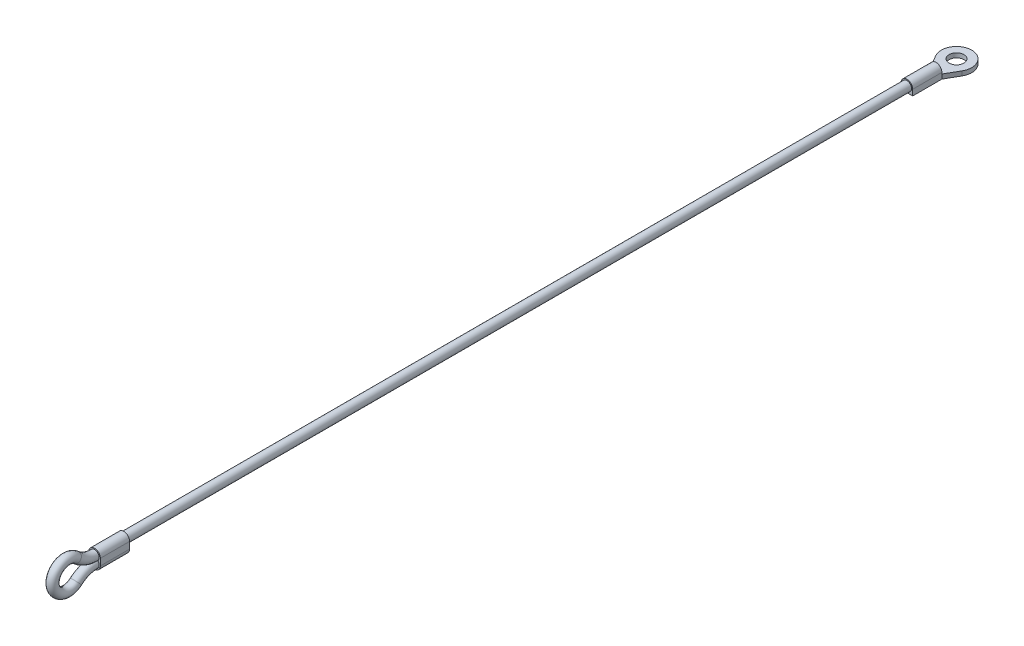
ISO-10303-21;
HEADER;
FILE_DESCRIPTION(('STEP AP214'),'2;1');
FILE_NAME('part.step','',(''),(''),'','','');
FILE_SCHEMA(('AUTOMOTIVE_DESIGN { 1 0 10303 214 1 1 1 1 }'));
ENDSEC;
DATA;
#1=APPLICATION_CONTEXT('core data for automotive mechanical design processes');
#2=APPLICATION_PROTOCOL_DEFINITION('international standard','automotive_design',2000,#1);
#3=PRODUCT_CONTEXT('',#1,'mechanical');
#4=PRODUCT('Part','Part','',(#3));
#5=PRODUCT_RELATED_PRODUCT_CATEGORY('part','',(#4));
#6=PRODUCT_DEFINITION_FORMATION('','',#4);
#7=PRODUCT_DEFINITION_CONTEXT('part definition',#1,'design');
#8=PRODUCT_DEFINITION('design','',#6,#7);
#9=PRODUCT_DEFINITION_SHAPE('','',#8);
#10=(LENGTH_UNIT() NAMED_UNIT(*) SI_UNIT(.MILLI.,.METRE.));
#11=(NAMED_UNIT(*) PLANE_ANGLE_UNIT() SI_UNIT($,.RADIAN.));
#12=(NAMED_UNIT(*) SI_UNIT($,.STERADIAN.) SOLID_ANGLE_UNIT());
#13=UNCERTAINTY_MEASURE_WITH_UNIT(LENGTH_MEASURE(1.E-05),#10,'distance_accuracy_value','');
#14=(GEOMETRIC_REPRESENTATION_CONTEXT(3) GLOBAL_UNCERTAINTY_ASSIGNED_CONTEXT((#13)) GLOBAL_UNIT_ASSIGNED_CONTEXT((#10,
#11,#12)) REPRESENTATION_CONTEXT('',''));
#15=CARTESIAN_POINT('',(0.,0.,0.));
#16=DIRECTION('',(0.,0.,1.));
#17=DIRECTION('',(1.,0.,0.));
#18=AXIS2_PLACEMENT_3D('',#15,#16,#17);
#19=CARTESIAN_POINT('',(0.,0.,-10.));
#20=DIRECTION('',(0.,0.,-1.));
#21=DIRECTION('',(-1.,0.,0.));
#22=AXIS2_PLACEMENT_3D('',#19,#20,#21);
#23=PLANE('',#22);
#24=DIRECTION('',(0.,-1.,0.));
#25=VECTOR('',#24,1.);
#26=CARTESIAN_POINT('',(1.99,0.,-10.));
#27=LINE('',#26,#25);
#28=CARTESIAN_POINT('',(1.99,0.,-10.));
#29=VERTEX_POINT('',#28);
#30=CARTESIAN_POINT('',(1.99,-0.47,-10.));
#31=VERTEX_POINT('',#30);
#32=EDGE_CURVE('E184',#29,#31,#27,.T.);
#33=ORIENTED_EDGE('',*,*,#32,.T.);
#34=DIRECTION('',(-1.,0.,0.));
#35=VECTOR('',#34,1.);
#36=CARTESIAN_POINT('',(-1.99,-0.47,-10.));
#37=LINE('',#36,#35);
#38=CARTESIAN_POINT('',(-1.99,-0.47,-10.));
#39=VERTEX_POINT('',#38);
#40=EDGE_CURVE('E141',#31,#39,#37,.T.);
#41=ORIENTED_EDGE('',*,*,#40,.T.);
#42=DIRECTION('',(0.,1.,0.));
#43=VECTOR('',#42,1.);
#44=CARTESIAN_POINT('',(-1.99,-1.99,-10.));
#45=LINE('',#44,#43);
#46=CARTESIAN_POINT('',(-1.99,0.,-10.));
#47=VERTEX_POINT('',#46);
#48=EDGE_CURVE('E189',#39,#47,#45,.T.);
#49=ORIENTED_EDGE('',*,*,#48,.T.);
#50=CARTESIAN_POINT('',(0.,0.,-10.));
#51=DIRECTION('',(0.,0.,-1.));
#52=DIRECTION('',(-1.,0.,0.));
#53=AXIS2_PLACEMENT_3D('',#50,#51,#52);
#54=CIRCLE('',#53,1.99);
#55=EDGE_CURVE('E180',#47,#29,#54,.T.);
#56=ORIENTED_EDGE('',*,*,#55,.T.);
#57=EDGE_LOOP('',(#33,#41,#49,#56));
#58=FACE_BOUND('',#57,.T.);
#59=ADVANCED_FACE('F39',(#58),#23,.T.);
#60=CARTESIAN_POINT('',(0.,0.,278.2));
#61=DIRECTION('',(0.,0.,-1.));
#62=DIRECTION('',(-1.,0.,0.));
#63=AXIS2_PLACEMENT_3D('',#60,#61,#62);
#64=CYLINDRICAL_SURFACE('',#63,1.59);
#65=CARTESIAN_POINT('',(0.,0.,268.2));
#66=DIRECTION('',(0.,0.,-1.));
#67=DIRECTION('',(0.,1.,0.));
#68=AXIS2_PLACEMENT_3D('',#65,#66,#67);
#69=CIRCLE('',#68,1.59);
#70=CARTESIAN_POINT('',(0.,1.59,268.2));
#71=VERTEX_POINT('',#70);
#72=EDGE_CURVE('E43',#71,#71,#69,.T.);
#73=ORIENTED_EDGE('',*,*,#72,.T.);
#74=EDGE_LOOP('',(#73));
#75=FACE_BOUND('',#74,.T.);
#76=CARTESIAN_POINT('',(0.,0.,0.));
#77=DIRECTION('',(0.,0.,1.));
#78=DIRECTION('',(1.,0.,0.));
#79=AXIS2_PLACEMENT_3D('',#76,#77,#78);
#80=CIRCLE('',#79,1.59);
#81=CARTESIAN_POINT('',(1.59,0.,0.));
#82=VERTEX_POINT('',#81);
#83=EDGE_CURVE('E219',#82,#82,#80,.T.);
#84=ORIENTED_EDGE('',*,*,#83,.T.);
#85=EDGE_LOOP('',(#84));
#86=FACE_BOUND('',#85,.T.);
#87=ADVANCED_FACE('F41',(#75,#86),#64,.T.);
#88=CARTESIAN_POINT('',(0.,3.87710696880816E-13,268.2));
#89=DIRECTION('',(0.,0.,1.));
#90=DIRECTION('',(0.,-1.,0.));
#91=AXIS2_PLACEMENT_3D('',#88,#89,#90);
#92=CYLINDRICAL_SURFACE('',#91,1.99);
#93=CARTESIAN_POINT('',(0.,4.0216672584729E-13,278.2));
#94=DIRECTION('',(0.,0.,-1.));
#95=DIRECTION('',(0.,1.,0.));
#96=AXIS2_PLACEMENT_3D('',#93,#94,#95);
#97=CIRCLE('',#96,1.99);
#98=CARTESIAN_POINT('',(-1.99,4.0241043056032E-13,278.2));
#99=VERTEX_POINT('',#98);
#100=CARTESIAN_POINT('',(1.99,4.0192302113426E-13,278.2));
#101=VERTEX_POINT('',#100);
#102=EDGE_CURVE('E235',#99,#101,#97,.T.);
#103=ORIENTED_EDGE('',*,*,#102,.T.);
#104=DIRECTION('',(0.,0.,1.));
#105=VECTOR('',#104,1.);
#106=CARTESIAN_POINT('',(1.99,3.87466992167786E-13,268.2));
#107=LINE('',#106,#105);
#108=CARTESIAN_POINT('',(1.99,3.87466992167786E-13,268.2));
#109=VERTEX_POINT('',#108);
#110=EDGE_CURVE('E257',#109,#101,#107,.T.);
#111=ORIENTED_EDGE('',*,*,#110,.F.);
#112=CARTESIAN_POINT('',(0.,3.87710696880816E-13,268.2));
#113=DIRECTION('',(0.,0.,-1.));
#114=DIRECTION('',(0.,1.,0.));
#115=AXIS2_PLACEMENT_3D('',#112,#113,#114);
#116=CIRCLE('',#115,1.99);
#117=CARTESIAN_POINT('',(-1.99,3.87954401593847E-13,268.2));
#118=VERTEX_POINT('',#117);
#119=EDGE_CURVE('E220',#118,#109,#116,.T.);
#120=ORIENTED_EDGE('',*,*,#119,.F.);
#121=DIRECTION('',(0.,0.,1.));
#122=VECTOR('',#121,1.);
#123=CARTESIAN_POINT('',(-1.99,3.87954401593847E-13,268.2));
#124=LINE('',#123,#122);
#125=EDGE_CURVE('E234',#118,#99,#124,.T.);
#126=ORIENTED_EDGE('',*,*,#125,.T.);
#127=EDGE_LOOP('',(#103,#111,#120,#126));
#128=FACE_BOUND('',#127,.T.);
#129=ADVANCED_FACE('F289',(#128),#92,.T.);
#130=CARTESIAN_POINT('',(1.99,3.87466992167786E-13,268.2));
#131=DIRECTION('',(-1.,0.,0.));
#132=DIRECTION('',(0.,-1.,0.));
#133=AXIS2_PLACEMENT_3D('',#130,#131,#132);
#134=PLANE('',#133);
#135=DIRECTION('',(0.,-1.,0.));
#136=VECTOR('',#135,1.);
#137=CARTESIAN_POINT('',(1.99,4.0192302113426E-13,278.2));
#138=LINE('',#137,#136);
#139=CARTESIAN_POINT('',(1.99,-2.26625258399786,278.2));
#140=VERTEX_POINT('',#139);
#141=EDGE_CURVE('E238',#101,#140,#138,.T.);
#142=ORIENTED_EDGE('',*,*,#141,.T.);
#143=DIRECTION('',(0.,0.,1.));
#144=VECTOR('',#143,1.);
#145=CARTESIAN_POINT('',(1.99,-2.26625258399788,268.2));
#146=LINE('',#145,#144);
#147=CARTESIAN_POINT('',(1.99,-2.26625258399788,268.2));
#148=VERTEX_POINT('',#147);
#149=EDGE_CURVE('E253',#148,#140,#146,.T.);
#150=ORIENTED_EDGE('',*,*,#149,.F.);
#151=DIRECTION('',(0.,-1.,0.));
#152=VECTOR('',#151,1.);
#153=CARTESIAN_POINT('',(1.99,3.87466992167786E-13,268.2));
#154=LINE('',#153,#152);
#155=EDGE_CURVE('E224',#109,#148,#154,.T.);
#156=ORIENTED_EDGE('',*,*,#155,.F.);
#157=ORIENTED_EDGE('',*,*,#110,.T.);
#158=EDGE_LOOP('',(#142,#150,#156,#157));
#159=FACE_BOUND('',#158,.T.);
#160=ADVANCED_FACE('F341',(#159),#134,.F.);
#161=CARTESIAN_POINT('',(0.,-2.26625258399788,268.2));
#162=DIRECTION('',(0.,0.,1.));
#163=DIRECTION('',(0.,-1.,0.));
#164=AXIS2_PLACEMENT_3D('',#161,#162,#163);
#165=CYLINDRICAL_SURFACE('',#164,1.99);
#166=CARTESIAN_POINT('',(0.,-2.26625258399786,278.2));
#167=DIRECTION('',(0.,0.,-1.));
#168=DIRECTION('',(0.,1.,0.));
#169=AXIS2_PLACEMENT_3D('',#166,#167,#168);
#170=CIRCLE('',#169,1.99);
#171=CARTESIAN_POINT('',(-1.99,-2.26625258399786,278.2));
#172=VERTEX_POINT('',#171);
#173=EDGE_CURVE('E241',#140,#172,#170,.T.);
#174=ORIENTED_EDGE('',*,*,#173,.T.);
#175=DIRECTION('',(0.,0.,1.));
#176=VECTOR('',#175,1.);
#177=CARTESIAN_POINT('',(-1.99,-2.26625258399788,268.2));
#178=LINE('',#177,#176);
#179=CARTESIAN_POINT('',(-1.99,-2.26625258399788,268.2));
#180=VERTEX_POINT('',#179);
#181=EDGE_CURVE('E249',#180,#172,#178,.T.);
#182=ORIENTED_EDGE('',*,*,#181,.F.);
#183=CARTESIAN_POINT('',(0.,-2.26625258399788,268.2));
#184=DIRECTION('',(0.,0.,-1.));
#185=DIRECTION('',(0.,1.,0.));
#186=AXIS2_PLACEMENT_3D('',#183,#184,#185);
#187=CIRCLE('',#186,1.99);
#188=EDGE_CURVE('E228',#148,#180,#187,.T.);
#189=ORIENTED_EDGE('',*,*,#188,.F.);
#190=ORIENTED_EDGE('',*,*,#149,.T.);
#191=EDGE_LOOP('',(#174,#182,#189,#190));
#192=FACE_BOUND('',#191,.T.);
#193=ADVANCED_FACE('F338',(#192),#165,.T.);
#194=CARTESIAN_POINT('',(-1.99,3.87954401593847E-13,268.2));
#195=DIRECTION('',(1.,0.,0.));
#196=DIRECTION('',(0.,1.,0.));
#197=AXIS2_PLACEMENT_3D('',#194,#195,#196);
#198=PLANE('',#197);
#199=DIRECTION('',(0.,1.,0.));
#200=VECTOR('',#199,1.);
#201=CARTESIAN_POINT('',(-1.99,4.0241043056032E-13,278.2));
#202=LINE('',#201,#200);
#203=EDGE_CURVE('E225',#172,#99,#202,.T.);
#204=ORIENTED_EDGE('',*,*,#203,.T.);
#205=ORIENTED_EDGE('',*,*,#125,.F.);
#206=DIRECTION('',(0.,1.,0.));
#207=VECTOR('',#206,1.);
#208=CARTESIAN_POINT('',(-1.99,3.87954401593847E-13,268.2));
#209=LINE('',#208,#207);
#210=EDGE_CURVE('E231',#180,#118,#209,.T.);
#211=ORIENTED_EDGE('',*,*,#210,.F.);
#212=ORIENTED_EDGE('',*,*,#181,.T.);
#213=EDGE_LOOP('',(#204,#205,#211,#212));
#214=FACE_BOUND('',#213,.T.);
#215=ADVANCED_FACE('F333',(#214),#198,.F.);
#216=CARTESIAN_POINT('',(0.,3.87710696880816E-13,268.2));
#217=DIRECTION('',(0.,0.,-1.));
#218=DIRECTION('',(0.,1.,0.));
#219=AXIS2_PLACEMENT_3D('',#216,#217,#218);
#220=PLANE('',#219);
#221=ORIENTED_EDGE('',*,*,#72,.F.);
#222=EDGE_LOOP('',(#221));
#223=FACE_BOUND('',#222,.T.);
#224=ORIENTED_EDGE('',*,*,#119,.T.);
#225=ORIENTED_EDGE('',*,*,#155,.T.);
#226=ORIENTED_EDGE('',*,*,#188,.T.);
#227=ORIENTED_EDGE('',*,*,#210,.T.);
#228=EDGE_LOOP('',(#224,#225,#226,#227));
#229=FACE_BOUND('',#228,.T.);
#230=ADVANCED_FACE('F300',(#223,#229),#220,.T.);
#231=CARTESIAN_POINT('',(0.,4.0216672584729E-13,278.2));
#232=DIRECTION('',(0.,0.,-1.));
#233=DIRECTION('',(0.,1.,0.));
#234=AXIS2_PLACEMENT_3D('',#231,#232,#233);
#235=PLANE('',#234);
#236=CARTESIAN_POINT('',(0.,0.,278.2));
#237=DIRECTION('',(0.,0.,1.));
#238=DIRECTION('',(1.,0.,0.));
#239=AXIS2_PLACEMENT_3D('',#236,#237,#238);
#240=CIRCLE('',#239,1.59);
#241=CARTESIAN_POINT('',(1.1154034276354,-1.13312629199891,278.2));
#242=VERTEX_POINT('',#241);
#243=CARTESIAN_POINT('',(-1.11540342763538,-1.13312629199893,278.2));
#244=VERTEX_POINT('',#243);
#245=EDGE_CURVE('E49',#242,#244,#240,.T.);
#246=ORIENTED_EDGE('',*,*,#245,.F.);
#247=CARTESIAN_POINT('',(0.,-2.26625258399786,278.2));
#248=DIRECTION('',(0.,0.,-1.));
#249=DIRECTION('',(1.,0.,0.));
#250=AXIS2_PLACEMENT_3D('',#247,#248,#249);
#251=CIRCLE('',#250,1.59);
#252=EDGE_CURVE('E63',#242,#244,#251,.T.);
#253=ORIENTED_EDGE('',*,*,#252,.T.);
#254=EDGE_LOOP('',(#246,#253));
#255=FACE_BOUND('',#254,.T.);
#256=ORIENTED_EDGE('',*,*,#102,.F.);
#257=ORIENTED_EDGE('',*,*,#203,.F.);
#258=ORIENTED_EDGE('',*,*,#173,.F.);
#259=ORIENTED_EDGE('',*,*,#141,.F.);
#260=EDGE_LOOP('',(#256,#257,#258,#259));
#261=FACE_BOUND('',#260,.T.);
#262=ADVANCED_FACE('F293',(#255,#261),#235,.F.);
#263=CARTESIAN_POINT('',(0.,-1.13312629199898,287.8));
#264=DIRECTION('',(-1.,0.,0.));
#265=DIRECTION('',(0.,0.,1.));
#266=AXIS2_PLACEMENT_3D('',#263,#264,#265);
#267=TOROIDAL_SURFACE('',#266,4.8,1.59);
#268=CARTESIAN_POINT('',(0.,-4.7108350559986,284.6));
#269=DIRECTION('',(0.,0.666666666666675,-0.745355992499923));
#270=DIRECTION('',(1.,0.,0.));
#271=AXIS2_PLACEMENT_3D('',#268,#269,#270);
#272=CIRCLE('',#271,1.59);
#273=CARTESIAN_POINT('',(0.,-5.89595108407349,283.54));
#274=VERTEX_POINT('',#273);
#275=EDGE_CURVE('E263',#274,#274,#272,.T.);
#276=CARTESIAN_POINT('',(0.,2.44458247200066,284.6));
#277=DIRECTION('',(0.,0.666666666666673,0.745355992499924));
#278=DIRECTION('',(1.,0.,0.));
#279=AXIS2_PLACEMENT_3D('',#276,#277,#278);
#280=CIRCLE('',#279,1.59);
#281=CARTESIAN_POINT('',(0.,3.62969850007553,283.54));
#282=VERTEX_POINT('',#281);
#283=EDGE_CURVE('E267',#282,#282,#280,.T.);
#284=CARTESIAN_POINT('',(0.,-1.13312629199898,287.8));
#285=DIRECTION('',(-1.,0.,0.));
#286=DIRECTION('',(0.,0.,1.));
#287=AXIS2_PLACEMENT_3D('',#284,#285,#286);
#288=CIRCLE('',#287,6.39);
#289=EDGE_CURVE('',#274,#282,#288,.T.);
#290=ORIENTED_EDGE('',*,*,#275,.F.);
#291=ORIENTED_EDGE('',*,*,#283,.T.);
#292=ORIENTED_EDGE('',*,*,#289,.T.);
#293=ORIENTED_EDGE('',*,*,#289,.F.);
#294=EDGE_LOOP('',(#290,#292,#291,#293));
#295=FACE_BOUND('',#294,.T.);
#296=ADVANCED_FACE('F291',(#295),#267,.T.);
#297=CARTESIAN_POINT('',(0.,9.6,278.2));
#298=DIRECTION('',(1.,0.,0.));
#299=DIRECTION('',(0.,0.,-1.));
#300=AXIS2_PLACEMENT_3D('',#297,#298,#299);
#301=TOROIDAL_SURFACE('',#300,9.59999999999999,1.59);
#302=ORIENTED_EDGE('',*,*,#283,.F.);
#303=EDGE_LOOP('',(#302));
#304=FACE_BOUND('',#303,.T.);
#305=CARTESIAN_POINT('',(1.11540342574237,-1.13312629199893,278.1998));
#306=CARTESIAN_POINT('',(1.11534851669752,-1.13312629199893,278.32773673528));
#307=CARTESIAN_POINT('',(1.11308141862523,-1.13312629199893,278.455686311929));
#308=CARTESIAN_POINT('',(1.10371453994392,-1.13312629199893,278.71155828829));
#309=CARTESIAN_POINT('',(1.09660901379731,-1.13312629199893,278.839480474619));
#310=CARTESIAN_POINT('',(1.07704253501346,-1.13312629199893,279.096418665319));
#311=CARTESIAN_POINT('',(1.06452051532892,-1.13312629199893,279.225430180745));
#312=CARTESIAN_POINT('',(1.03319430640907,-1.13312629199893,279.482627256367));
#313=CARTESIAN_POINT('',(1.01439338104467,-1.13312629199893,279.610813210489));
#314=CARTESIAN_POINT('',(0.96690872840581,-1.13312629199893,279.878005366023));
#315=CARTESIAN_POINT('',(0.937456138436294,-1.13312629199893,280.016883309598));
#316=CARTESIAN_POINT('',(0.883915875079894,-1.13312629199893,280.222631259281));
#317=CARTESIAN_POINT('',(0.864530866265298,-1.13312629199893,280.290724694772));
#318=CARTESIAN_POINT('',(0.821996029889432,-1.13312629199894,280.425715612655));
#319=CARTESIAN_POINT('',(0.7988476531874,-1.13312629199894,280.49261354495));
#320=CARTESIAN_POINT('',(0.744519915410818,-1.13312629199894,280.633542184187));
#321=CARTESIAN_POINT('',(0.712679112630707,-1.13312629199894,280.707321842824));
#322=CARTESIAN_POINT('',(0.641279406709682,-1.13312629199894,280.851146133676));
#323=CARTESIAN_POINT('',(0.60172727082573,-1.13312629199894,280.921193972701));
#324=CARTESIAN_POINT('',(0.528948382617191,-1.13312629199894,281.02943568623));
#325=CARTESIAN_POINT('',(0.498892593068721,-1.13312629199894,281.069741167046));
#326=CARTESIAN_POINT('',(0.433770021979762,-1.13312629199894,281.146140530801));
#327=CARTESIAN_POINT('',(0.398710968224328,-1.13312629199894,281.182240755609));
#328=CARTESIAN_POINT('',(0.33506020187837,-1.13312629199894,281.237058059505));
#329=CARTESIAN_POINT('',(0.30806656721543,-1.13312629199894,281.257612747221));
#330=CARTESIAN_POINT('',(0.251279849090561,-1.13312629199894,281.294433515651));
#331=CARTESIAN_POINT('',(0.221491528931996,-1.13312629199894,281.310706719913));
#332=CARTESIAN_POINT('',(0.165682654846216,-1.13312629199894,281.334797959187));
#333=CARTESIAN_POINT('',(0.140117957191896,-1.13312629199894,281.343660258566));
#334=CARTESIAN_POINT('',(0.0878641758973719,-1.13312629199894,281.356990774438));
#335=CARTESIAN_POINT('',(0.0611762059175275,-1.13312629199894,281.361463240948));
#336=CARTESIAN_POINT('',(0.00731772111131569,-1.13312629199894,281.365572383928));
#337=CARTESIAN_POINT('',(-0.0198542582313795,-1.13312629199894,281.365190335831));
#338=CARTESIAN_POINT('',(-0.0736951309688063,-1.13312629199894,281.359586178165));
#339=CARTESIAN_POINT('',(-0.100363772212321,-1.13312629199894,281.354361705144));
#340=CARTESIAN_POINT('',(-0.151195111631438,-1.13312629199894,281.339957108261));
#341=CARTESIAN_POINT('',(-0.175416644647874,-1.13312629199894,281.330979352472));
#342=CARTESIAN_POINT('',(-0.222373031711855,-1.13312629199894,281.309774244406));
#343=CARTESIAN_POINT('',(-0.245107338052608,-1.13312629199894,281.297545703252));
#344=CARTESIAN_POINT('',(-0.304759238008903,-1.13312629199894,281.260748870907));
#345=CARTESIAN_POINT('',(-0.340101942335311,-1.13312629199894,281.233635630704));
#346=CARTESIAN_POINT('',(-0.406281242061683,-1.13312629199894,281.17436880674));
#347=CARTESIAN_POINT('',(-0.437102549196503,-1.13312629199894,281.142198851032));
#348=CARTESIAN_POINT('',(-0.49271853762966,-1.13312629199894,281.07701365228));
#349=CARTESIAN_POINT('',(-0.517788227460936,-1.13312629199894,281.044229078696));
#350=CARTESIAN_POINT('',(-0.565060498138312,-1.13312629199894,280.976639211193));
#351=CARTESIAN_POINT('',(-0.58726042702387,-1.13312629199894,280.941832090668));
#352=CARTESIAN_POINT('',(-0.650275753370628,-1.13312629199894,280.835150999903));
#353=CARTESIAN_POINT('',(-0.687428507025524,-1.13312629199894,280.761116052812));
#354=CARTESIAN_POINT('',(-0.745434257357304,-1.13312629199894,280.630275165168));
#355=CARTESIAN_POINT('',(-0.767985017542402,-1.13312629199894,280.574182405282));
#356=CARTESIAN_POINT('',(-0.809859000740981,-1.13312629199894,280.460796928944));
#357=CARTESIAN_POINT('',(-0.829181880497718,-1.13312629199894,280.403504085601));
#358=CARTESIAN_POINT('',(-0.883166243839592,-1.13312629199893,280.230173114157));
#359=CARTESIAN_POINT('',(-0.913763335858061,-1.13312629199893,280.112874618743));
#360=CARTESIAN_POINT('',(-0.967023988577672,-1.13312629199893,279.875955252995));
#361=CARTESIAN_POINT('',(-0.989647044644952,-1.13312629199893,279.756325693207));
#362=CARTESIAN_POINT('',(-1.02845868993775,-1.13312629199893,279.516012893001));
#363=CARTESIAN_POINT('',(-1.04464572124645,-1.13312629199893,279.395329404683));
#364=CARTESIAN_POINT('',(-1.06818793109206,-1.13312629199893,279.18453669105));
#365=CARTESIAN_POINT('',(-1.07674400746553,-1.13312629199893,279.094556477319));
#366=CARTESIAN_POINT('',(-1.09119671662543,-1.13312629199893,278.914367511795));
#367=CARTESIAN_POINT('',(-1.09709289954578,-1.13312629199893,278.824158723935));
#368=CARTESIAN_POINT('',(-1.10635885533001,-1.13312629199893,278.644939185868));
#369=CARTESIAN_POINT('',(-1.10976438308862,-1.13312629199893,278.555930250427));
#370=CARTESIAN_POINT('',(-1.11428069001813,-1.13312629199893,278.377880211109));
#371=CARTESIAN_POINT('',(-1.11539214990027,-1.13312629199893,278.288839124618));
#372=CARTESIAN_POINT('',(-1.11540342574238,-1.13312629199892,278.1998));
#373=B_SPLINE_CURVE_WITH_KNOTS('',3,(#305,#306,#307,#308,#309,#310,#311,#312,#313,#314,#315,
#316,#317,#318,#319,#320,#321,#322,#323,#324,#325,#326,#327,#328,#329,#330,#331,#332,#333,#334,
#335,#336,#337,#338,#339,#340,#341,#342,#343,#344,#345,#346,#347,#348,#349,#350,#351,#352,#353,
#354,#355,#356,#357,#358,#359,#360,#361,#362,#363,#364,#365,#366,#367,#368,#369,#370,#371,#372),
.UNSPECIFIED.,.F.,.F.,(4,2,2,2,2,2,2,2,2,2,2,2,2,2,2,2,2,2,2,2,2,2,2,2,2,2,2,2,2,2,2,2,2,4),(0.,
0.383810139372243,0.768076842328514,1.15679365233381,1.54530871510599,1.97071269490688,
2.18302701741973,2.3952596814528,2.63604166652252,2.87661329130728,3.02716706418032,
3.17749076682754,3.27898827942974,3.38031583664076,3.46115731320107,3.54192044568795,
3.62299518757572,3.70410952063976,3.78132200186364,3.85856276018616,3.99142265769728,
4.12472192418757,4.24834991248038,4.37209134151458,4.61994843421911,4.80123584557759,
4.98254252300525,5.34577733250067,5.71083149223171,6.0759739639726,6.3470943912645,
6.61826065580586,6.88545336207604,7.15256677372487),.UNSPECIFIED.);
#374=EDGE_CURVE('E11',#242,#244,#373,.T.);
#375=ORIENTED_EDGE('',*,*,#374,.F.);
#376=ORIENTED_EDGE('',*,*,#245,.T.);
#377=EDGE_LOOP('',(#375,#376));
#378=FACE_BOUND('',#377,.T.);
#379=ADVANCED_FACE('F280',(#304,#378),#301,.T.);
#380=CARTESIAN_POINT('',(0.,-11.8662525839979,278.2));
#381=DIRECTION('',(1.,0.,0.));
#382=DIRECTION('',(0.,0.,-1.));
#383=AXIS2_PLACEMENT_3D('',#380,#381,#382);
#384=TOROIDAL_SURFACE('',#383,9.6,1.59);
#385=ORIENTED_EDGE('',*,*,#275,.T.);
#386=EDGE_LOOP('',(#385));
#387=FACE_BOUND('',#386,.T.);
#388=ORIENTED_EDGE('',*,*,#252,.F.);
#389=ORIENTED_EDGE('',*,*,#374,.T.);
#390=EDGE_LOOP('',(#388,#389));
#391=FACE_BOUND('',#390,.T.);
#392=ADVANCED_FACE('F283',(#387,#391),#384,.T.);
#393=CARTESIAN_POINT('',(0.,0.,-10.));
#394=DIRECTION('',(0.,0.,1.));
#395=DIRECTION('',(1.,0.,0.));
#396=AXIS2_PLACEMENT_3D('',#393,#394,#395);
#397=CYLINDRICAL_SURFACE('',#396,1.99);
#398=CARTESIAN_POINT('',(0.,0.,0.));
#399=DIRECTION('',(0.,0.,-1.));
#400=DIRECTION('',(-1.,0.,0.));
#401=AXIS2_PLACEMENT_3D('',#398,#399,#400);
#402=CIRCLE('',#401,1.99);
#403=CARTESIAN_POINT('',(-1.99,0.,0.));
#404=VERTEX_POINT('',#403);
#405=CARTESIAN_POINT('',(1.99,0.,0.));
#406=VERTEX_POINT('',#405);
#407=EDGE_CURVE('E177',#404,#406,#402,.T.);
#408=ORIENTED_EDGE('',*,*,#407,.T.);
#409=DIRECTION('',(0.,0.,1.));
#410=VECTOR('',#409,1.);
#411=CARTESIAN_POINT('',(1.99,0.,-10.));
#412=LINE('',#411,#410);
#413=EDGE_CURVE('E215',#29,#406,#412,.T.);
#414=ORIENTED_EDGE('',*,*,#413,.F.);
#415=ORIENTED_EDGE('',*,*,#55,.F.);
#416=DIRECTION('',(0.,0.,1.));
#417=VECTOR('',#416,1.);
#418=CARTESIAN_POINT('',(-1.99,0.,-10.));
#419=LINE('',#418,#417);
#420=EDGE_CURVE('E192',#47,#404,#419,.T.);
#421=ORIENTED_EDGE('',*,*,#420,.T.);
#422=EDGE_LOOP('',(#408,#414,#415,#421));
#423=FACE_BOUND('',#422,.T.);
#424=ADVANCED_FACE('F287',(#423),#397,.T.);
#425=CARTESIAN_POINT('',(1.99,0.,-10.));
#426=DIRECTION('',(-1.,0.,0.));
#427=DIRECTION('',(0.,-1.,0.));
#428=AXIS2_PLACEMENT_3D('',#425,#426,#427);
#429=PLANE('',#428);
#430=DIRECTION('',(0.,-1.,0.));
#431=VECTOR('',#430,1.);
#432=CARTESIAN_POINT('',(1.99,0.,0.));
#433=LINE('',#432,#431);
#434=CARTESIAN_POINT('',(1.99,-1.99,0.));
#435=VERTEX_POINT('',#434);
#436=EDGE_CURVE('E196',#406,#435,#433,.T.);
#437=ORIENTED_EDGE('',*,*,#436,.T.);
#438=DIRECTION('',(0.,0.,1.));
#439=VECTOR('',#438,1.);
#440=CARTESIAN_POINT('',(1.99,-1.99,-10.));
#441=LINE('',#440,#439);
#442=CARTESIAN_POINT('',(1.99,-1.99,-10.));
#443=VERTEX_POINT('',#442);
#444=EDGE_CURVE('E211',#443,#435,#441,.T.);
#445=ORIENTED_EDGE('',*,*,#444,.F.);
#446=DIRECTION('',(0.,-1.,0.));
#447=VECTOR('',#446,1.);
#448=CARTESIAN_POINT('',(1.99,-0.47,-10.));
#449=LINE('',#448,#447);
#450=EDGE_CURVE('E174',#31,#443,#449,.T.);
#451=ORIENTED_EDGE('',*,*,#450,.F.);
#452=ORIENTED_EDGE('',*,*,#32,.F.);
#453=ORIENTED_EDGE('',*,*,#413,.T.);
#454=EDGE_LOOP('',(#437,#445,#451,#452,#453));
#455=FACE_BOUND('',#454,.T.);
#456=ADVANCED_FACE('F324',(#455),#429,.F.);
#457=CARTESIAN_POINT('',(0.,-1.99,-10.));
#458=DIRECTION('',(0.,1.,0.));
#459=DIRECTION('',(0.,0.,1.));
#460=AXIS2_PLACEMENT_3D('',#457,#458,#459);
#461=PLANE('',#460);
#462=DIRECTION('',(-1.,0.,0.));
#463=VECTOR('',#462,1.);
#464=CARTESIAN_POINT('',(0.,-1.99,0.));
#465=LINE('',#464,#463);
#466=CARTESIAN_POINT('',(-1.99,-1.99,0.));
#467=VERTEX_POINT('',#466);
#468=EDGE_CURVE('E200',#435,#467,#465,.T.);
#469=ORIENTED_EDGE('',*,*,#468,.T.);
#470=DIRECTION('',(0.,0.,1.));
#471=VECTOR('',#470,1.);
#472=CARTESIAN_POINT('',(-1.99,-1.99,-10.));
#473=LINE('',#472,#471);
#474=CARTESIAN_POINT('',(-1.99,-1.99,-10.));
#475=VERTEX_POINT('',#474);
#476=EDGE_CURVE('E208',#475,#467,#473,.T.);
#477=ORIENTED_EDGE('',*,*,#476,.F.);
#478=DIRECTION('',(-0.496859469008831,0.,-0.867831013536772));
#479=VECTOR('',#478,1.);
#480=CARTESIAN_POINT('',(-4.5170604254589,-1.99,-14.413846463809));
#481=LINE('',#480,#479);
#482=CARTESIAN_POINT('',(-4.5170604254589,-1.99,-14.413846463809));
#483=VERTEX_POINT('',#482);
#484=EDGE_CURVE('E168',#475,#483,#481,.T.);
#485=ORIENTED_EDGE('',*,*,#484,.T.);
#486=CARTESIAN_POINT('',(0.,-1.99,-17.));
#487=DIRECTION('',(0.,-1.,0.));
#488=DIRECTION('',(0.,0.,1.));
#489=AXIS2_PLACEMENT_3D('',#486,#487,#488);
#490=CIRCLE('',#489,5.205);
#491=CARTESIAN_POINT('',(4.5170604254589,-1.99,-14.413846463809));
#492=VERTEX_POINT('',#491);
#493=EDGE_CURVE('E136',#483,#492,#490,.T.);
#494=ORIENTED_EDGE('',*,*,#493,.T.);
#495=DIRECTION('',(-0.496859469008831,0.,0.867831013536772));
#496=VECTOR('',#495,1.);
#497=CARTESIAN_POINT('',(1.99,-1.99,-10.));
#498=LINE('',#497,#496);
#499=EDGE_CURVE('E153',#492,#443,#498,.T.);
#500=ORIENTED_EDGE('',*,*,#499,.T.);
#501=ORIENTED_EDGE('',*,*,#444,.T.);
#502=EDGE_LOOP('',(#469,#477,#485,#494,#500,#501));
#503=FACE_BOUND('',#502,.T.);
#504=CARTESIAN_POINT('',(0.,-1.99,-17.));
#505=DIRECTION('',(0.,-1.,0.));
#506=DIRECTION('',(0.,0.,-1.));
#507=AXIS2_PLACEMENT_3D('',#504,#505,#506);
#508=CIRCLE('',#507,2.54);
#509=CARTESIAN_POINT('',(0.,-1.99,-19.54));
#510=VERTEX_POINT('',#509);
#511=EDGE_CURVE('E161',#510,#510,#508,.T.);
#512=ORIENTED_EDGE('',*,*,#511,.F.);
#513=EDGE_LOOP('',(#512));
#514=FACE_BOUND('',#513,.T.);
#515=ADVANCED_FACE('F320',(#503,#514),#461,.F.);
#516=CARTESIAN_POINT('',(-1.99,-1.99,-10.));
#517=DIRECTION('',(1.,0.,0.));
#518=DIRECTION('',(0.,1.,0.));
#519=AXIS2_PLACEMENT_3D('',#516,#517,#518);
#520=PLANE('',#519);
#521=DIRECTION('',(0.,1.,0.));
#522=VECTOR('',#521,1.);
#523=CARTESIAN_POINT('',(-1.99,-1.99,0.));
#524=LINE('',#523,#522);
#525=EDGE_CURVE('E185',#467,#404,#524,.T.);
#526=ORIENTED_EDGE('',*,*,#525,.T.);
#527=ORIENTED_EDGE('',*,*,#420,.F.);
#528=ORIENTED_EDGE('',*,*,#48,.F.);
#529=EDGE_CURVE('E150',#475,#39,#45,.T.);
#530=ORIENTED_EDGE('',*,*,#529,.F.);
#531=ORIENTED_EDGE('',*,*,#476,.T.);
#532=EDGE_LOOP('',(#526,#527,#528,#530,#531));
#533=FACE_BOUND('',#532,.T.);
#534=ADVANCED_FACE('F316',(#533),#520,.F.);
#535=CARTESIAN_POINT('',(0.,0.,0.));
#536=DIRECTION('',(0.,0.,-1.));
#537=DIRECTION('',(-1.,0.,0.));
#538=AXIS2_PLACEMENT_3D('',#535,#536,#537);
#539=PLANE('',#538);
#540=ORIENTED_EDGE('',*,*,#83,.F.);
#541=EDGE_LOOP('',(#540));
#542=FACE_BOUND('',#541,.T.);
#543=ORIENTED_EDGE('',*,*,#407,.F.);
#544=ORIENTED_EDGE('',*,*,#525,.F.);
#545=ORIENTED_EDGE('',*,*,#468,.F.);
#546=ORIENTED_EDGE('',*,*,#436,.F.);
#547=EDGE_LOOP('',(#543,#544,#545,#546));
#548=FACE_BOUND('',#547,.T.);
#549=ADVANCED_FACE('F313',(#542,#548),#539,.F.);
#550=CARTESIAN_POINT('',(-4.5170604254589,-0.47,-14.413846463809));
#551=DIRECTION('',(-0.867831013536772,0.,0.496859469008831));
#552=DIRECTION('',(0.496859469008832,0.,0.867831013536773));
#553=AXIS2_PLACEMENT_3D('',#550,#551,#552);
#554=PLANE('',#553);
#555=ORIENTED_EDGE('',*,*,#484,.F.);
#556=ORIENTED_EDGE('',*,*,#529,.T.);
#557=DIRECTION('',(-0.496859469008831,0.,-0.867831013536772));
#558=VECTOR('',#557,1.);
#559=CARTESIAN_POINT('',(-4.5170604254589,-0.47,-14.413846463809));
#560=LINE('',#559,#558);
#561=CARTESIAN_POINT('',(-4.5170604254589,-0.47,-14.413846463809));
#562=VERTEX_POINT('',#561);
#563=EDGE_CURVE('E56',#39,#562,#560,.T.);
#564=ORIENTED_EDGE('',*,*,#563,.T.);
#565=DIRECTION('',(0.,-1.,0.));
#566=VECTOR('',#565,1.);
#567=CARTESIAN_POINT('',(-4.5170604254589,-0.47,-14.413846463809));
#568=LINE('',#567,#566);
#569=EDGE_CURVE('E132',#562,#483,#568,.T.);
#570=ORIENTED_EDGE('',*,*,#569,.T.);
#571=EDGE_LOOP('',(#555,#556,#564,#570));
#572=FACE_BOUND('',#571,.T.);
#573=ADVANCED_FACE('F148',(#572),#554,.T.);
#574=CARTESIAN_POINT('',(1.99,-0.47,-10.));
#575=DIRECTION('',(0.867831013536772,0.,0.496859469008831));
#576=DIRECTION('',(0.496859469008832,0.,-0.867831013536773));
#577=AXIS2_PLACEMENT_3D('',#574,#575,#576);
#578=PLANE('',#577);
#579=ORIENTED_EDGE('',*,*,#499,.F.);
#580=DIRECTION('',(0.,-1.,0.));
#581=VECTOR('',#580,1.);
#582=CARTESIAN_POINT('',(4.5170604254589,-0.47,-14.413846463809));
#583=LINE('',#582,#581);
#584=CARTESIAN_POINT('',(4.5170604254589,-0.47,-14.413846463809));
#585=VERTEX_POINT('',#584);
#586=EDGE_CURVE('E140',#585,#492,#583,.T.);
#587=ORIENTED_EDGE('',*,*,#586,.F.);
#588=DIRECTION('',(-0.496859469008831,0.,0.867831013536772));
#589=VECTOR('',#588,1.);
#590=CARTESIAN_POINT('',(1.99,-0.47,-10.));
#591=LINE('',#590,#589);
#592=EDGE_CURVE('E145',#585,#31,#591,.T.);
#593=ORIENTED_EDGE('',*,*,#592,.T.);
#594=ORIENTED_EDGE('',*,*,#450,.T.);
#595=EDGE_LOOP('',(#579,#587,#593,#594));
#596=FACE_BOUND('',#595,.T.);
#597=ADVANCED_FACE('F408',(#596),#578,.T.);
#598=CARTESIAN_POINT('',(0.,-0.47,-17.));
#599=DIRECTION('',(0.,-1.,0.));
#600=DIRECTION('',(0.,0.,-1.));
#601=AXIS2_PLACEMENT_3D('',#598,#599,#600);
#602=CYLINDRICAL_SURFACE('',#601,5.205);
#603=ORIENTED_EDGE('',*,*,#493,.F.);
#604=ORIENTED_EDGE('',*,*,#569,.F.);
#605=CARTESIAN_POINT('',(0.,-0.47,-17.));
#606=DIRECTION('',(0.,-1.,0.));
#607=DIRECTION('',(0.,0.,1.));
#608=AXIS2_PLACEMENT_3D('',#605,#606,#607);
#609=CIRCLE('',#608,5.205);
#610=EDGE_CURVE('E134',#562,#585,#609,.T.);
#611=ORIENTED_EDGE('',*,*,#610,.T.);
#612=ORIENTED_EDGE('',*,*,#586,.T.);
#613=EDGE_LOOP('',(#603,#604,#611,#612));
#614=FACE_BOUND('',#613,.T.);
#615=ADVANCED_FACE('F133',(#614),#602,.T.);
#616=CARTESIAN_POINT('',(0.,-0.47,-17.));
#617=DIRECTION('',(0.,1.,0.));
#618=DIRECTION('',(0.,0.,1.));
#619=AXIS2_PLACEMENT_3D('',#616,#617,#618);
#620=PLANE('',#619);
#621=CARTESIAN_POINT('',(0.,-0.47,-17.));
#622=DIRECTION('',(0.,-1.,0.));
#623=DIRECTION('',(0.,0.,-1.));
#624=AXIS2_PLACEMENT_3D('',#621,#622,#623);
#625=CIRCLE('',#624,2.54);
#626=CARTESIAN_POINT('',(0.,-0.47,-19.54));
#627=VERTEX_POINT('',#626);
#628=EDGE_CURVE('E171',#627,#627,#625,.T.);
#629=ORIENTED_EDGE('',*,*,#628,.T.);
#630=EDGE_LOOP('',(#629));
#631=FACE_BOUND('',#630,.T.);
#632=ORIENTED_EDGE('',*,*,#563,.F.);
#633=ORIENTED_EDGE('',*,*,#40,.F.);
#634=ORIENTED_EDGE('',*,*,#592,.F.);
#635=ORIENTED_EDGE('',*,*,#610,.F.);
#636=EDGE_LOOP('',(#632,#633,#634,#635));
#637=FACE_BOUND('',#636,.T.);
#638=ADVANCED_FACE('F144',(#631,#637),#620,.T.);
#639=CARTESIAN_POINT('',(0.,-0.47,-17.));
#640=DIRECTION('',(0.,-1.,0.));
#641=DIRECTION('',(0.,0.,-1.));
#642=AXIS2_PLACEMENT_3D('',#639,#640,#641);
#643=CYLINDRICAL_SURFACE('',#642,2.54);
#644=ORIENTED_EDGE('',*,*,#628,.F.);
#645=EDGE_LOOP('',(#644));
#646=FACE_BOUND('',#645,.T.);
#647=ORIENTED_EDGE('',*,*,#511,.T.);
#648=EDGE_LOOP('',(#647));
#649=FACE_BOUND('',#648,.T.);
#650=ADVANCED_FACE('F432',(#646,#649),#643,.F.);
#651=CLOSED_SHELL('',(#59,#87,#129,#160,#193,#215,#230,#262,#296,#379,#392,#424,#456,#515,#534,
#549,#573,#597,#615,#638,#650));
#652=MANIFOLD_SOLID_BREP('B2',#651);
#653=ADVANCED_BREP_SHAPE_REPRESENTATION('',(#18,#652),#14);
#654=SHAPE_DEFINITION_REPRESENTATION(#9,#653);
ENDSEC;
END-ISO-10303-21;
